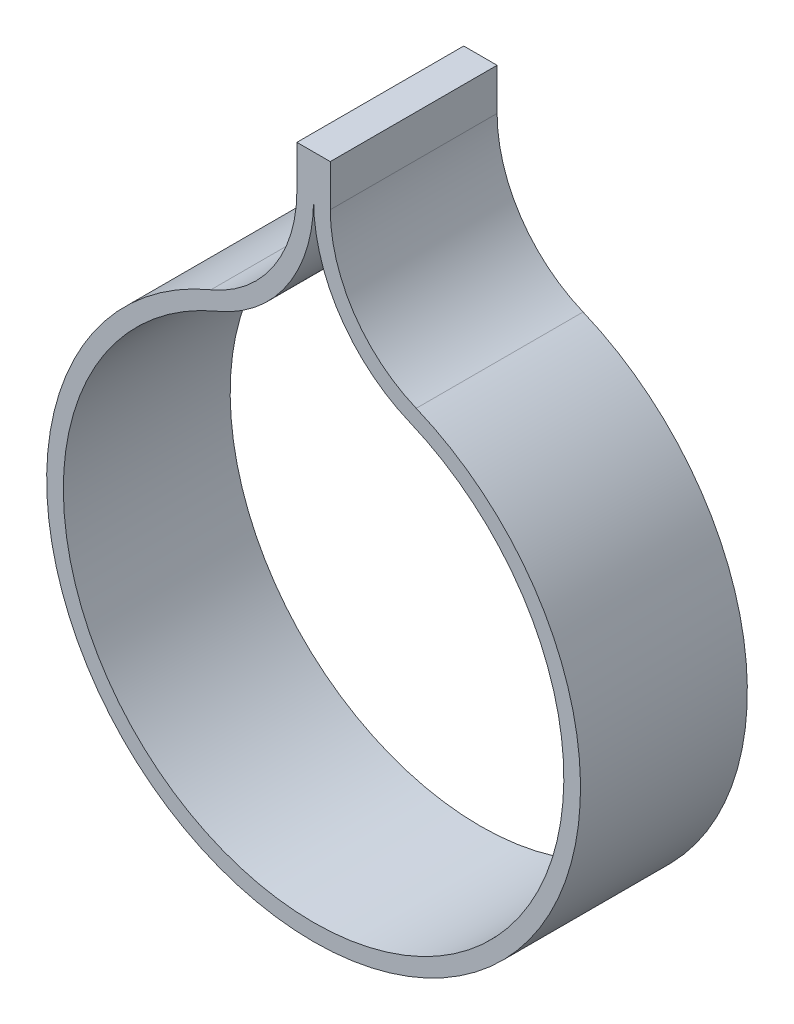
ISO-10303-21;
HEADER;
FILE_DESCRIPTION(('STEP AP214'),'2;1');
FILE_NAME('part.step','',(''),(''),'','','');
FILE_SCHEMA(('AUTOMOTIVE_DESIGN { 1 0 10303 214 1 1 1 1 }'));
ENDSEC;
DATA;
#1=APPLICATION_CONTEXT('core data for automotive mechanical design processes');
#2=APPLICATION_PROTOCOL_DEFINITION('international standard','automotive_design',2000,#1);
#3=PRODUCT_CONTEXT('',#1,'mechanical');
#4=PRODUCT('Part','Part','',(#3));
#5=PRODUCT_RELATED_PRODUCT_CATEGORY('part','',(#4));
#6=PRODUCT_DEFINITION_FORMATION('','',#4);
#7=PRODUCT_DEFINITION_CONTEXT('part definition',#1,'design');
#8=PRODUCT_DEFINITION('design','',#6,#7);
#9=PRODUCT_DEFINITION_SHAPE('','',#8);
#10=(LENGTH_UNIT() NAMED_UNIT(*) SI_UNIT(.MILLI.,.METRE.));
#11=(NAMED_UNIT(*) PLANE_ANGLE_UNIT() SI_UNIT($,.RADIAN.));
#12=(NAMED_UNIT(*) SI_UNIT($,.STERADIAN.) SOLID_ANGLE_UNIT());
#13=UNCERTAINTY_MEASURE_WITH_UNIT(LENGTH_MEASURE(1.E-05),#10,'distance_accuracy_value','');
#14=(GEOMETRIC_REPRESENTATION_CONTEXT(3) GLOBAL_UNCERTAINTY_ASSIGNED_CONTEXT((#13)) GLOBAL_UNIT_ASSIGNED_CONTEXT((#10,
#11,#12)) REPRESENTATION_CONTEXT('',''));
#15=CARTESIAN_POINT('',(0.,0.,0.));
#16=DIRECTION('',(0.,0.,1.));
#17=DIRECTION('',(1.,0.,0.));
#18=AXIS2_PLACEMENT_3D('',#15,#16,#17);
#19=CARTESIAN_POINT('',(-23.8125,57.15,25.4));
#20=DIRECTION('',(0.,0.,1.));
#21=DIRECTION('',(1.,0.,0.));
#22=AXIS2_PLACEMENT_3D('',#19,#20,#21);
#23=PLANE('',#22);
#24=CARTESIAN_POINT('',(-23.8125,57.15,25.4));
#25=DIRECTION('',(0.,0.,-1.));
#26=DIRECTION('',(1.,0.,0.));
#27=AXIS2_PLACEMENT_3D('',#24,#25,#26);
#28=CIRCLE('',#27,21.2725);
#29=CARTESIAN_POINT('',(-2.54,57.15,25.4));
#30=VERTEX_POINT('',#29);
#31=CARTESIAN_POINT('',(-15.6307692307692,37.5138461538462,25.4));
#32=VERTEX_POINT('',#31);
#33=EDGE_CURVE('E153',#30,#32,#28,.T.);
#34=ORIENTED_EDGE('',*,*,#33,.T.);
#35=CARTESIAN_POINT('',(0.,0.,25.4));
#36=DIRECTION('',(0.,0.,1.));
#37=DIRECTION('',(1.,0.,0.));
#38=AXIS2_PLACEMENT_3D('',#35,#36,#37);
#39=CIRCLE('',#38,40.64);
#40=CARTESIAN_POINT('',(15.6307692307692,37.5138461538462,25.4));
#41=VERTEX_POINT('',#40);
#42=EDGE_CURVE('E157',#32,#41,#39,.T.);
#43=ORIENTED_EDGE('',*,*,#42,.T.);
#44=CARTESIAN_POINT('',(23.8125,57.15,25.4));
#45=DIRECTION('',(0.,0.,-1.));
#46=DIRECTION('',(1.,0.,0.));
#47=AXIS2_PLACEMENT_3D('',#44,#45,#46);
#48=CIRCLE('',#47,21.2725);
#49=CARTESIAN_POINT('',(2.54,57.15,25.4));
#50=VERTEX_POINT('',#49);
#51=EDGE_CURVE('E161',#41,#50,#48,.T.);
#52=ORIENTED_EDGE('',*,*,#51,.T.);
#53=DIRECTION('',(0.,1.,0.));
#54=VECTOR('',#53,1.);
#55=CARTESIAN_POINT('',(2.54,57.15,25.4));
#56=LINE('',#55,#54);
#57=CARTESIAN_POINT('',(2.54,63.5,25.4));
#58=VERTEX_POINT('',#57);
#59=EDGE_CURVE('E164',#50,#58,#56,.T.);
#60=ORIENTED_EDGE('',*,*,#59,.T.);
#61=DIRECTION('',(-1.,0.,0.));
#62=VECTOR('',#61,1.);
#63=CARTESIAN_POINT('',(-2.54,63.5,25.4));
#64=LINE('',#63,#62);
#65=CARTESIAN_POINT('',(-2.54,63.5,25.4));
#66=VERTEX_POINT('',#65);
#67=EDGE_CURVE('E167',#58,#66,#64,.T.);
#68=ORIENTED_EDGE('',*,*,#67,.T.);
#69=DIRECTION('',(0.,-1.,0.));
#70=VECTOR('',#69,1.);
#71=CARTESIAN_POINT('',(-2.54,57.15,25.4));
#72=LINE('',#71,#70);
#73=EDGE_CURVE('E170',#66,#30,#72,.T.);
#74=ORIENTED_EDGE('',*,*,#73,.T.);
#75=EDGE_LOOP('',(#34,#43,#52,#60,#68,#74));
#76=FACE_BOUND('',#75,.T.);
#77=CARTESIAN_POINT('',(-23.8125,57.15,25.4));
#78=DIRECTION('',(0.,0.,-1.));
#79=DIRECTION('',(1.,0.,0.));
#80=AXIS2_PLACEMENT_3D('',#77,#78,#79);
#81=CIRCLE('',#80,23.8125);
#82=CARTESIAN_POINT('',(0.,57.15,25.4));
#83=VERTEX_POINT('',#82);
#84=CARTESIAN_POINT('',(-14.6538461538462,35.1692307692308,25.4));
#85=VERTEX_POINT('',#84);
#86=EDGE_CURVE('E126',#83,#85,#81,.T.);
#87=ORIENTED_EDGE('',*,*,#86,.F.);
#88=CARTESIAN_POINT('',(23.8125,57.15,25.4));
#89=DIRECTION('',(0.,0.,-1.));
#90=DIRECTION('',(1.,0.,0.));
#91=AXIS2_PLACEMENT_3D('',#88,#89,#90);
#92=CIRCLE('',#91,23.8125);
#93=CARTESIAN_POINT('',(14.6538461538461,35.1692307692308,25.4));
#94=VERTEX_POINT('',#93);
#95=EDGE_CURVE('E117',#94,#83,#92,.T.);
#96=ORIENTED_EDGE('',*,*,#95,.F.);
#97=CARTESIAN_POINT('',(0.,0.,25.4));
#98=DIRECTION('',(0.,0.,1.));
#99=DIRECTION('',(1.,0.,0.));
#100=AXIS2_PLACEMENT_3D('',#97,#98,#99);
#101=CIRCLE('',#100,38.1);
#102=EDGE_CURVE('E136',#85,#94,#101,.T.);
#103=ORIENTED_EDGE('',*,*,#102,.F.);
#104=EDGE_LOOP('',(#87,#96,#103));
#105=FACE_BOUND('',#104,.T.);
#106=ADVANCED_FACE('F45',(#76,#105),#23,.T.);
#107=CARTESIAN_POINT('',(-23.8125,57.15,0.));
#108=DIRECTION('',(0.,0.,1.));
#109=DIRECTION('',(1.,0.,0.));
#110=AXIS2_PLACEMENT_3D('',#107,#108,#109);
#111=PLANE('',#110);
#112=CARTESIAN_POINT('',(-23.8125,57.15,0.));
#113=DIRECTION('',(0.,0.,-1.));
#114=DIRECTION('',(1.,0.,0.));
#115=AXIS2_PLACEMENT_3D('',#112,#113,#114);
#116=CIRCLE('',#115,21.2725);
#117=CARTESIAN_POINT('',(-2.54,57.15,0.));
#118=VERTEX_POINT('',#117);
#119=CARTESIAN_POINT('',(-15.6307692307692,37.5138461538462,0.));
#120=VERTEX_POINT('',#119);
#121=EDGE_CURVE('E134',#118,#120,#116,.T.);
#122=ORIENTED_EDGE('',*,*,#121,.F.);
#123=DIRECTION('',(0.,-1.,0.));
#124=VECTOR('',#123,1.);
#125=CARTESIAN_POINT('',(-2.54,57.15,0.));
#126=LINE('',#125,#124);
#127=CARTESIAN_POINT('',(-2.54,63.5,0.));
#128=VERTEX_POINT('',#127);
#129=EDGE_CURVE('E158',#128,#118,#126,.T.);
#130=ORIENTED_EDGE('',*,*,#129,.F.);
#131=DIRECTION('',(-1.,0.,0.));
#132=VECTOR('',#131,1.);
#133=CARTESIAN_POINT('',(-2.54,63.5,0.));
#134=LINE('',#133,#132);
#135=CARTESIAN_POINT('',(2.54,63.5,0.));
#136=VERTEX_POINT('',#135);
#137=EDGE_CURVE('E186',#136,#128,#134,.T.);
#138=ORIENTED_EDGE('',*,*,#137,.F.);
#139=DIRECTION('',(0.,1.,0.));
#140=VECTOR('',#139,1.);
#141=CARTESIAN_POINT('',(2.54,57.15,0.));
#142=LINE('',#141,#140);
#143=CARTESIAN_POINT('',(2.54,57.15,0.));
#144=VERTEX_POINT('',#143);
#145=EDGE_CURVE('E183',#144,#136,#142,.T.);
#146=ORIENTED_EDGE('',*,*,#145,.F.);
#147=CARTESIAN_POINT('',(23.8125,57.15,0.));
#148=DIRECTION('',(0.,0.,-1.));
#149=DIRECTION('',(1.,0.,0.));
#150=AXIS2_PLACEMENT_3D('',#147,#148,#149);
#151=CIRCLE('',#150,21.2725);
#152=CARTESIAN_POINT('',(15.6307692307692,37.5138461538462,0.));
#153=VERTEX_POINT('',#152);
#154=EDGE_CURVE('E180',#153,#144,#151,.T.);
#155=ORIENTED_EDGE('',*,*,#154,.F.);
#156=CARTESIAN_POINT('',(0.,0.,0.));
#157=DIRECTION('',(0.,0.,1.));
#158=DIRECTION('',(1.,0.,0.));
#159=AXIS2_PLACEMENT_3D('',#156,#157,#158);
#160=CIRCLE('',#159,40.64);
#161=EDGE_CURVE('E177',#120,#153,#160,.T.);
#162=ORIENTED_EDGE('',*,*,#161,.F.);
#163=EDGE_LOOP('',(#122,#130,#138,#146,#155,#162));
#164=FACE_BOUND('',#163,.T.);
#165=CARTESIAN_POINT('',(23.8125,57.15,0.));
#166=DIRECTION('',(0.,0.,-1.));
#167=DIRECTION('',(1.,0.,0.));
#168=AXIS2_PLACEMENT_3D('',#165,#166,#167);
#169=CIRCLE('',#168,23.8125);
#170=CARTESIAN_POINT('',(14.6538461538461,35.1692307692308,0.));
#171=VERTEX_POINT('',#170);
#172=CARTESIAN_POINT('',(0.,57.15,0.));
#173=VERTEX_POINT('',#172);
#174=EDGE_CURVE('E69',#171,#173,#169,.T.);
#175=ORIENTED_EDGE('',*,*,#174,.T.);
#176=CARTESIAN_POINT('',(-23.8125,57.15,0.));
#177=DIRECTION('',(0.,0.,-1.));
#178=DIRECTION('',(1.,0.,0.));
#179=AXIS2_PLACEMENT_3D('',#176,#177,#178);
#180=CIRCLE('',#179,23.8125);
#181=CARTESIAN_POINT('',(-14.6538461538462,35.1692307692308,0.));
#182=VERTEX_POINT('',#181);
#183=EDGE_CURVE('E132',#173,#182,#180,.T.);
#184=ORIENTED_EDGE('',*,*,#183,.T.);
#185=CARTESIAN_POINT('',(0.,0.,0.));
#186=DIRECTION('',(0.,0.,1.));
#187=DIRECTION('',(1.,0.,0.));
#188=AXIS2_PLACEMENT_3D('',#185,#186,#187);
#189=CIRCLE('',#188,38.1);
#190=EDGE_CURVE('E127',#182,#171,#189,.T.);
#191=ORIENTED_EDGE('',*,*,#190,.T.);
#192=EDGE_LOOP('',(#175,#184,#191));
#193=FACE_BOUND('',#192,.T.);
#194=ADVANCED_FACE('F217',(#164,#193),#111,.F.);
#195=CARTESIAN_POINT('',(-23.8125,57.15,25.4));
#196=DIRECTION('',(0.,0.,-1.));
#197=DIRECTION('',(-1.,0.,0.));
#198=AXIS2_PLACEMENT_3D('',#195,#196,#197);
#199=CYLINDRICAL_SURFACE('',#198,21.2725);
#200=ORIENTED_EDGE('',*,*,#121,.T.);
#201=DIRECTION('',(0.,0.,-1.));
#202=VECTOR('',#201,1.);
#203=CARTESIAN_POINT('',(-15.6307692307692,37.5138461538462,25.4));
#204=LINE('',#203,#202);
#205=EDGE_CURVE('E11',#32,#120,#204,.T.);
#206=ORIENTED_EDGE('',*,*,#205,.F.);
#207=ORIENTED_EDGE('',*,*,#33,.F.);
#208=DIRECTION('',(0.,0.,-1.));
#209=VECTOR('',#208,1.);
#210=CARTESIAN_POINT('',(-2.54,57.15,25.4));
#211=LINE('',#210,#209);
#212=EDGE_CURVE('E173',#30,#118,#211,.T.);
#213=ORIENTED_EDGE('',*,*,#212,.T.);
#214=EDGE_LOOP('',(#200,#206,#207,#213));
#215=FACE_BOUND('',#214,.T.);
#216=ADVANCED_FACE('F47',(#215),#199,.F.);
#217=CARTESIAN_POINT('',(0.,0.,25.4));
#218=DIRECTION('',(0.,0.,-1.));
#219=DIRECTION('',(-1.,0.,0.));
#220=AXIS2_PLACEMENT_3D('',#217,#218,#219);
#221=CYLINDRICAL_SURFACE('',#220,40.64);
#222=ORIENTED_EDGE('',*,*,#161,.T.);
#223=DIRECTION('',(0.,0.,-1.));
#224=VECTOR('',#223,1.);
#225=CARTESIAN_POINT('',(15.6307692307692,37.5138461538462,25.4));
#226=LINE('',#225,#224);
#227=EDGE_CURVE('E54',#41,#153,#226,.T.);
#228=ORIENTED_EDGE('',*,*,#227,.F.);
#229=ORIENTED_EDGE('',*,*,#42,.F.);
#230=ORIENTED_EDGE('',*,*,#205,.T.);
#231=EDGE_LOOP('',(#222,#228,#229,#230));
#232=FACE_BOUND('',#231,.T.);
#233=ADVANCED_FACE('F234',(#232),#221,.T.);
#234=CARTESIAN_POINT('',(23.8125,57.15,25.4));
#235=DIRECTION('',(0.,0.,-1.));
#236=DIRECTION('',(-1.,0.,0.));
#237=AXIS2_PLACEMENT_3D('',#234,#235,#236);
#238=CYLINDRICAL_SURFACE('',#237,21.2725);
#239=ORIENTED_EDGE('',*,*,#154,.T.);
#240=DIRECTION('',(0.,0.,-1.));
#241=VECTOR('',#240,1.);
#242=CARTESIAN_POINT('',(2.54,57.15,25.4));
#243=LINE('',#242,#241);
#244=EDGE_CURVE('E202',#50,#144,#243,.T.);
#245=ORIENTED_EDGE('',*,*,#244,.F.);
#246=ORIENTED_EDGE('',*,*,#51,.F.);
#247=ORIENTED_EDGE('',*,*,#227,.T.);
#248=EDGE_LOOP('',(#239,#245,#246,#247));
#249=FACE_BOUND('',#248,.T.);
#250=ADVANCED_FACE('F211',(#249),#238,.F.);
#251=CARTESIAN_POINT('',(2.54,57.15,25.4));
#252=DIRECTION('',(-1.,0.,0.));
#253=DIRECTION('',(0.,0.,1.));
#254=AXIS2_PLACEMENT_3D('',#251,#252,#253);
#255=PLANE('',#254);
#256=ORIENTED_EDGE('',*,*,#145,.T.);
#257=DIRECTION('',(0.,0.,-1.));
#258=VECTOR('',#257,1.);
#259=CARTESIAN_POINT('',(2.54,63.5,25.4));
#260=LINE('',#259,#258);
#261=EDGE_CURVE('E198',#58,#136,#260,.T.);
#262=ORIENTED_EDGE('',*,*,#261,.F.);
#263=ORIENTED_EDGE('',*,*,#59,.F.);
#264=ORIENTED_EDGE('',*,*,#244,.T.);
#265=EDGE_LOOP('',(#256,#262,#263,#264));
#266=FACE_BOUND('',#265,.T.);
#267=ADVANCED_FACE('F223',(#266),#255,.F.);
#268=CARTESIAN_POINT('',(-2.54,63.5,25.4));
#269=DIRECTION('',(0.,-1.,0.));
#270=DIRECTION('',(0.,0.,-1.));
#271=AXIS2_PLACEMENT_3D('',#268,#269,#270);
#272=PLANE('',#271);
#273=ORIENTED_EDGE('',*,*,#137,.T.);
#274=DIRECTION('',(0.,0.,-1.));
#275=VECTOR('',#274,1.);
#276=CARTESIAN_POINT('',(-2.54,63.5,25.4));
#277=LINE('',#276,#275);
#278=EDGE_CURVE('E194',#66,#128,#277,.T.);
#279=ORIENTED_EDGE('',*,*,#278,.F.);
#280=ORIENTED_EDGE('',*,*,#67,.F.);
#281=ORIENTED_EDGE('',*,*,#261,.T.);
#282=EDGE_LOOP('',(#273,#279,#280,#281));
#283=FACE_BOUND('',#282,.T.);
#284=ADVANCED_FACE('F227',(#283),#272,.F.);
#285=CARTESIAN_POINT('',(-2.54,57.15,25.4));
#286=DIRECTION('',(1.,0.,0.));
#287=DIRECTION('',(0.,0.,-1.));
#288=AXIS2_PLACEMENT_3D('',#285,#286,#287);
#289=PLANE('',#288);
#290=ORIENTED_EDGE('',*,*,#129,.T.);
#291=ORIENTED_EDGE('',*,*,#212,.F.);
#292=ORIENTED_EDGE('',*,*,#73,.F.);
#293=ORIENTED_EDGE('',*,*,#278,.T.);
#294=EDGE_LOOP('',(#290,#291,#292,#293));
#295=FACE_BOUND('',#294,.T.);
#296=ADVANCED_FACE('F237',(#295),#289,.F.);
#297=CARTESIAN_POINT('',(23.8125,57.15,25.4));
#298=DIRECTION('',(0.,0.,-1.));
#299=DIRECTION('',(-1.,0.,0.));
#300=AXIS2_PLACEMENT_3D('',#297,#298,#299);
#301=CYLINDRICAL_SURFACE('',#300,23.8125);
#302=ORIENTED_EDGE('',*,*,#174,.F.);
#303=DIRECTION('',(0.,0.,-1.));
#304=VECTOR('',#303,1.);
#305=CARTESIAN_POINT('',(14.6538461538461,35.1692307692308,25.4));
#306=LINE('',#305,#304);
#307=EDGE_CURVE('E121',#94,#171,#306,.T.);
#308=ORIENTED_EDGE('',*,*,#307,.F.);
#309=ORIENTED_EDGE('',*,*,#95,.T.);
#310=DIRECTION('',(0.,0.,-1.));
#311=VECTOR('',#310,1.);
#312=CARTESIAN_POINT('',(0.,57.15,25.4));
#313=LINE('',#312,#311);
#314=EDGE_CURVE('E120',#83,#173,#313,.T.);
#315=ORIENTED_EDGE('',*,*,#314,.T.);
#316=EDGE_LOOP('',(#302,#308,#309,#315));
#317=FACE_BOUND('',#316,.T.);
#318=ADVANCED_FACE('F119',(#317),#301,.T.);
#319=CARTESIAN_POINT('',(-23.8125,57.15,25.4));
#320=DIRECTION('',(0.,0.,-1.));
#321=DIRECTION('',(-1.,0.,0.));
#322=AXIS2_PLACEMENT_3D('',#319,#320,#321);
#323=CYLINDRICAL_SURFACE('',#322,23.8125);
#324=ORIENTED_EDGE('',*,*,#183,.F.);
#325=ORIENTED_EDGE('',*,*,#314,.F.);
#326=ORIENTED_EDGE('',*,*,#86,.T.);
#327=DIRECTION('',(0.,0.,-1.));
#328=VECTOR('',#327,1.);
#329=CARTESIAN_POINT('',(-14.6538461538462,35.1692307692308,25.4));
#330=LINE('',#329,#328);
#331=EDGE_CURVE('E61',#85,#182,#330,.T.);
#332=ORIENTED_EDGE('',*,*,#331,.T.);
#333=EDGE_LOOP('',(#324,#325,#326,#332));
#334=FACE_BOUND('',#333,.T.);
#335=ADVANCED_FACE('F130',(#334),#323,.T.);
#336=CARTESIAN_POINT('',(0.,0.,25.4));
#337=DIRECTION('',(0.,0.,-1.));
#338=DIRECTION('',(-1.,0.,0.));
#339=AXIS2_PLACEMENT_3D('',#336,#337,#338);
#340=CYLINDRICAL_SURFACE('',#339,38.1);
#341=ORIENTED_EDGE('',*,*,#190,.F.);
#342=ORIENTED_EDGE('',*,*,#331,.F.);
#343=ORIENTED_EDGE('',*,*,#102,.T.);
#344=ORIENTED_EDGE('',*,*,#307,.T.);
#345=EDGE_LOOP('',(#341,#342,#343,#344));
#346=FACE_BOUND('',#345,.T.);
#347=ADVANCED_FACE('F255',(#346),#340,.F.);
#348=CLOSED_SHELL('',(#106,#194,#216,#233,#250,#267,#284,#296,#318,#335,#347));
#349=MANIFOLD_SOLID_BREP('B2',#348);
#350=ADVANCED_BREP_SHAPE_REPRESENTATION('',(#18,#349),#14);
#351=SHAPE_DEFINITION_REPRESENTATION(#9,#350);
ENDSEC;
END-ISO-10303-21;
